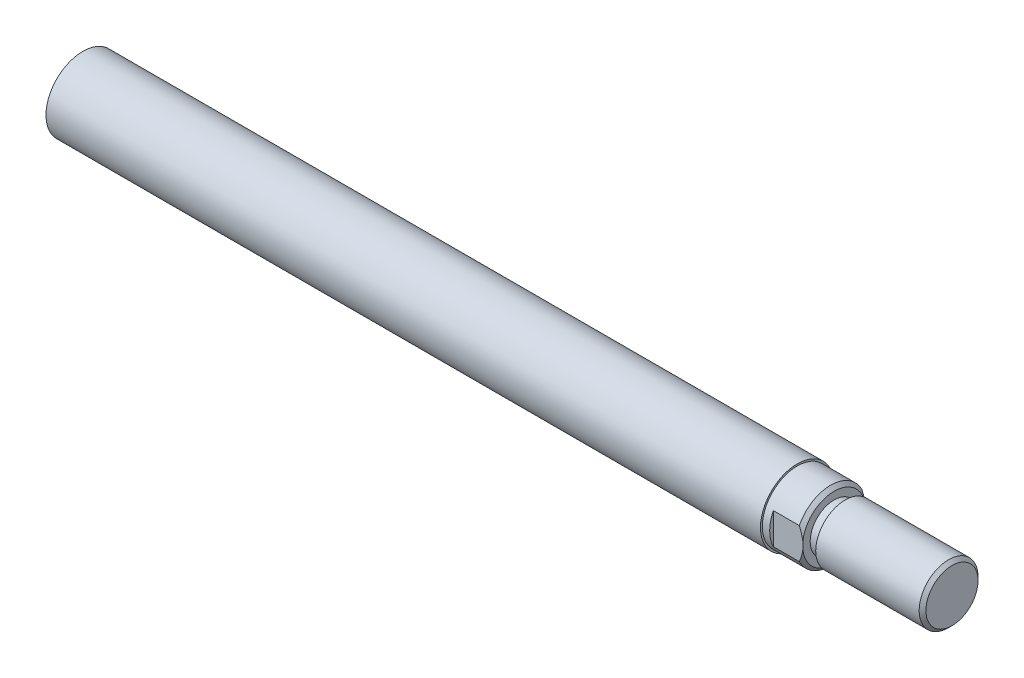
ISO-10303-21;
HEADER;
FILE_DESCRIPTION(('STEP AP214'),'2;1');
FILE_NAME('part.step','',(''),(''),'','','');
FILE_SCHEMA(('AUTOMOTIVE_DESIGN { 1 0 10303 214 1 1 1 1 }'));
ENDSEC;
DATA;
#1=APPLICATION_CONTEXT('core data for automotive mechanical design processes');
#2=APPLICATION_PROTOCOL_DEFINITION('international standard','automotive_design',2000,#1);
#3=PRODUCT_CONTEXT('',#1,'mechanical');
#4=PRODUCT('Part','Part','',(#3));
#5=PRODUCT_RELATED_PRODUCT_CATEGORY('part','',(#4));
#6=PRODUCT_DEFINITION_FORMATION('','',#4);
#7=PRODUCT_DEFINITION_CONTEXT('part definition',#1,'design');
#8=PRODUCT_DEFINITION('design','',#6,#7);
#9=PRODUCT_DEFINITION_SHAPE('','',#8);
#10=(LENGTH_UNIT() NAMED_UNIT(*) SI_UNIT(.MILLI.,.METRE.));
#11=(NAMED_UNIT(*) PLANE_ANGLE_UNIT() SI_UNIT($,.RADIAN.));
#12=(NAMED_UNIT(*) SI_UNIT($,.STERADIAN.) SOLID_ANGLE_UNIT());
#13=UNCERTAINTY_MEASURE_WITH_UNIT(LENGTH_MEASURE(1.E-05),#10,'distance_accuracy_value','');
#14=(GEOMETRIC_REPRESENTATION_CONTEXT(3) GLOBAL_UNCERTAINTY_ASSIGNED_CONTEXT((#13)) GLOBAL_UNIT_ASSIGNED_CONTEXT((#10,
#11,#12)) REPRESENTATION_CONTEXT('',''));
#15=CARTESIAN_POINT('',(0.,0.,0.));
#16=DIRECTION('',(0.,0.,1.));
#17=DIRECTION('',(1.,0.,0.));
#18=AXIS2_PLACEMENT_3D('',#15,#16,#17);
#19=CARTESIAN_POINT('',(-219.,0.,0.));
#20=DIRECTION('',(1.,0.,0.));
#21=DIRECTION('',(0.,0.,1.));
#22=AXIS2_PLACEMENT_3D('',#19,#20,#21);
#23=CYLINDRICAL_SURFACE('',#22,10.);
#24=CARTESIAN_POINT('',(-187.,0.,0.));
#25=DIRECTION('',(1.,0.,0.));
#26=DIRECTION('',(0.,0.,-1.));
#27=AXIS2_PLACEMENT_3D('',#24,#25,#26);
#28=CIRCLE('',#27,10.);
#29=CARTESIAN_POINT('',(-187.,0.,-10.));
#30=VERTEX_POINT('',#29);
#31=EDGE_CURVE('E128',#30,#30,#28,.F.);
#32=ORIENTED_EDGE('',*,*,#31,.F.);
#33=EDGE_LOOP('',(#32));
#34=FACE_BOUND('',#33,.T.);
#35=CARTESIAN_POINT('',(7.00000000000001,0.,0.));
#36=DIRECTION('',(-1.,0.,0.));
#37=DIRECTION('',(0.,0.,1.));
#38=AXIS2_PLACEMENT_3D('',#35,#36,#37);
#39=CIRCLE('',#38,10.);
#40=CARTESIAN_POINT('',(7.00000000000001,0.,10.));
#41=VERTEX_POINT('',#40);
#42=EDGE_CURVE('E234',#41,#41,#39,.T.);
#43=ORIENTED_EDGE('',*,*,#42,.T.);
#44=EDGE_LOOP('',(#43));
#45=FACE_BOUND('',#44,.T.);
#46=ADVANCED_FACE('F45',(#34,#45),#23,.T.);
#47=CARTESIAN_POINT('',(9.00000000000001,-17.,8.5));
#48=DIRECTION('',(0.,0.,-1.));
#49=DIRECTION('',(-1.,0.,0.));
#50=AXIS2_PLACEMENT_3D('',#47,#48,#49);
#51=PLANE('',#50);
#52=DIRECTION('',(0.,1.,0.));
#53=VECTOR('',#52,1.);
#54=CARTESIAN_POINT('',(17.,-17.,8.5));
#55=LINE('',#54,#53);
#56=CARTESIAN_POINT('',(17.,-0.923309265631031,8.5));
#57=VERTEX_POINT('',#56);
#58=CARTESIAN_POINT('',(17.,0.923309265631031,8.5));
#59=VERTEX_POINT('',#58);
#60=EDGE_CURVE('E133',#57,#59,#55,.T.);
#61=ORIENTED_EDGE('',*,*,#60,.T.);
#62=CARTESIAN_POINT('',(16.0500000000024,4.24264068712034,8.50000000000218));
#63=CARTESIAN_POINT('',(16.1108303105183,4.10642759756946,8.49999684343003));
#64=CARTESIAN_POINT('',(16.1697247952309,3.96933332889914,8.49998580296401));
#65=CARTESIAN_POINT('',(16.281839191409,3.69655476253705,8.49996516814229));
#66=CARTESIAN_POINT('',(16.3351590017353,3.56091145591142,8.49995554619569));
#67=CARTESIAN_POINT('',(16.4361343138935,3.29070114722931,8.49995329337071));
#68=CARTESIAN_POINT('',(16.4838837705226,3.15616940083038,8.49996031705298));
#69=CARTESIAN_POINT('',(16.5737176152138,2.8878314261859,8.49998693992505));
#70=CARTESIAN_POINT('',(16.615886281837,2.75405346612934,8.50000631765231));
#71=CARTESIAN_POINT('',(16.6972369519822,2.4778718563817,8.49999334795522));
#72=CARTESIAN_POINT('',(16.7361427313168,2.33538644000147,8.49995820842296));
#73=CARTESIAN_POINT('',(16.8070946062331,2.05151309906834,8.49989573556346));
#74=CARTESIAN_POINT('',(16.8392543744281,1.91015370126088,8.49986826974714));
#75=CARTESIAN_POINT('',(16.8967234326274,1.62795772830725,8.49986814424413));
#76=CARTESIAN_POINT('',(16.922116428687,1.48713829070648,8.49989477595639));
#77=CARTESIAN_POINT('',(16.9661190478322,1.20543874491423,8.49995424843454));
#78=CARTESIAN_POINT('',(16.9847741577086,1.06456572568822,8.49998704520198));
#79=CARTESIAN_POINT('',(17.,0.923309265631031,8.5));
#80=B_SPLINE_CURVE_WITH_KNOTS('',3,(#62,#63,#64,#65,#66,#67,#68,#69,#70,#71,#72,#73,#74,#75,#76,
#77,#78,#79),.UNSPECIFIED.,.F.,.F.,(4,2,2,2,2,2,2,2,4),(0.,0.447543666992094,0.884712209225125,
1.31288807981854,1.73359624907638,2.17657255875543,2.61134694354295,3.04046312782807,
3.46662571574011),.UNSPECIFIED.);
#81=CARTESIAN_POINT('',(16.05,4.24264068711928,8.5));
#82=VERTEX_POINT('',#81);
#83=EDGE_CURVE('E182',#82,#59,#80,.T.);
#84=ORIENTED_EDGE('',*,*,#83,.F.);
#85=DIRECTION('',(1.,0.,0.));
#86=VECTOR('',#85,1.);
#87=CARTESIAN_POINT('',(-239.,4.24264068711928,8.5));
#88=LINE('',#87,#86);
#89=CARTESIAN_POINT('',(9.00000000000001,4.24264068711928,8.5));
#90=VERTEX_POINT('',#89);
#91=EDGE_CURVE('E172',#90,#82,#88,.T.);
#92=ORIENTED_EDGE('',*,*,#91,.F.);
#93=DIRECTION('',(0.,1.,0.));
#94=VECTOR('',#93,1.);
#95=CARTESIAN_POINT('',(9.00000000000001,-17.,8.5));
#96=LINE('',#95,#94);
#97=CARTESIAN_POINT('',(9.00000000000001,-4.24264068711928,8.5));
#98=VERTEX_POINT('',#97);
#99=EDGE_CURVE('E227',#98,#90,#96,.T.);
#100=ORIENTED_EDGE('',*,*,#99,.F.);
#101=DIRECTION('',(-1.,0.,0.));
#102=VECTOR('',#101,1.);
#103=CARTESIAN_POINT('',(-239.,-4.24264068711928,8.5));
#104=LINE('',#103,#102);
#105=CARTESIAN_POINT('',(16.05,-4.24264068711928,8.5));
#106=VERTEX_POINT('',#105);
#107=EDGE_CURVE('E140',#106,#98,#104,.T.);
#108=ORIENTED_EDGE('',*,*,#107,.F.);
#109=CARTESIAN_POINT('',(17.,-0.923309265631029,8.5));
#110=CARTESIAN_POINT('',(16.9847986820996,-1.06433669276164,8.49998715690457));
#111=CARTESIAN_POINT('',(16.9661789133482,-1.20498190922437,8.49995492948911));
#112=CARTESIAN_POINT('',(16.9222674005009,-1.48623025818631,8.49989675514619));
#113=CARTESIAN_POINT('',(16.8969302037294,-1.62682631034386,8.49987085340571));
#114=CARTESIAN_POINT('',(16.8395930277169,-1.90857722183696,8.49987182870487));
#115=CARTESIAN_POINT('',(16.8075096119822,-2.04971501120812,8.49989940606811));
#116=CARTESIAN_POINT('',(16.7367308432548,-2.33314431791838,8.49996070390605));
#117=CARTESIAN_POINT('',(16.6979222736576,-2.47540744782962,8.49999453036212));
#118=CARTESIAN_POINT('',(16.6166508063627,-2.75158596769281,8.50000521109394));
#119=CARTESIAN_POINT('',(16.5744473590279,-2.88557807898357,8.49998468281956));
#120=CARTESIAN_POINT('',(16.4845233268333,-3.15434937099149,8.49995708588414));
#121=CARTESIAN_POINT('',(16.4367179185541,-3.28910011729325,8.49995026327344));
#122=CARTESIAN_POINT('',(16.3356105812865,-3.55975580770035,8.49995333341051));
#123=CARTESIAN_POINT('',(16.2822140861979,-3.69562527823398,8.49996358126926));
#124=CARTESIAN_POINT('',(16.1699261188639,-3.96886559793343,8.49998530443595));
#125=CARTESIAN_POINT('',(16.1109340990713,-4.10619519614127,8.49999680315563));
#126=CARTESIAN_POINT('',(16.0500000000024,-4.24264068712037,8.50000000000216));
#127=B_SPLINE_CURVE_WITH_KNOTS('',3,(#109,#110,#111,#112,#113,#114,#115,#116,#117,#118,#119,
#120,#121,#122,#123,#124,#125,#126),.UNSPECIFIED.,.F.,.F.,(4,2,2,2,2,2,2,2,4),(0.,
0.425471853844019,0.853899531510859,1.28797548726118,1.7302322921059,2.15158395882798,
2.58043464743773,3.01831843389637,3.46662578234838),.UNSPECIFIED.);
#128=EDGE_CURVE('E248',#57,#106,#127,.T.);
#129=ORIENTED_EDGE('',*,*,#128,.F.);
#130=EDGE_LOOP('',(#61,#84,#92,#100,#108,#129));
#131=FACE_BOUND('',#130,.T.);
#132=ADVANCED_FACE('F151',(#131),#51,.F.);
#133=CARTESIAN_POINT('',(7.00000000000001,9.5,0.));
#134=DIRECTION('',(-1.,0.,0.));
#135=DIRECTION('',(0.,1.,0.));
#136=AXIS2_PLACEMENT_3D('',#133,#134,#135);
#137=PLANE('',#136);
#138=ORIENTED_EDGE('',*,*,#42,.F.);
#139=EDGE_LOOP('',(#138));
#140=FACE_BOUND('',#139,.T.);
#141=CARTESIAN_POINT('',(7.00000000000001,0.,0.));
#142=DIRECTION('',(-1.,0.,0.));
#143=DIRECTION('',(0.,0.,1.));
#144=AXIS2_PLACEMENT_3D('',#141,#142,#143);
#145=CIRCLE('',#144,9.5);
#146=CARTESIAN_POINT('',(7.00000000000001,0.,9.5));
#147=VERTEX_POINT('',#146);
#148=EDGE_CURVE('E229',#147,#147,#145,.T.);
#149=ORIENTED_EDGE('',*,*,#148,.T.);
#150=EDGE_LOOP('',(#149));
#151=FACE_BOUND('',#150,.T.);
#152=ADVANCED_FACE('F161',(#140,#151),#137,.F.);
#153=CARTESIAN_POINT('',(-239.,0.,0.));
#154=DIRECTION('',(1.,0.,0.));
#155=DIRECTION('',(0.,0.,1.));
#156=AXIS2_PLACEMENT_3D('',#153,#154,#155);
#157=CYLINDRICAL_SURFACE('',#156,9.5);
#158=CARTESIAN_POINT('',(16.05,0.,0.));
#159=DIRECTION('',(-1.,0.,0.));
#160=DIRECTION('',(0.,0.,1.));
#161=AXIS2_PLACEMENT_3D('',#158,#159,#160);
#162=CIRCLE('',#161,9.5);
#163=CARTESIAN_POINT('',(16.05,4.24264068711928,-8.5));
#164=VERTEX_POINT('',#163);
#165=EDGE_CURVE('E233',#82,#164,#162,.T.);
#166=ORIENTED_EDGE('',*,*,#165,.T.);
#167=DIRECTION('',(-1.,0.,0.));
#168=VECTOR('',#167,1.);
#169=CARTESIAN_POINT('',(-239.,4.24264068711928,-8.5));
#170=LINE('',#169,#168);
#171=CARTESIAN_POINT('',(9.00000000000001,4.24264068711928,-8.5));
#172=VERTEX_POINT('',#171);
#173=EDGE_CURVE('E222',#164,#172,#170,.T.);
#174=ORIENTED_EDGE('',*,*,#173,.T.);
#175=CARTESIAN_POINT('',(9.00000000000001,0.,0.));
#176=DIRECTION('',(-1.,0.,0.));
#177=DIRECTION('',(0.,0.,1.));
#178=AXIS2_PLACEMENT_3D('',#175,#176,#177);
#179=CIRCLE('',#178,9.5);
#180=CARTESIAN_POINT('',(9.00000000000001,-4.24264068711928,-8.5));
#181=VERTEX_POINT('',#180);
#182=EDGE_CURVE('E217',#172,#181,#179,.T.);
#183=ORIENTED_EDGE('',*,*,#182,.T.);
#184=DIRECTION('',(1.,0.,0.));
#185=VECTOR('',#184,1.);
#186=CARTESIAN_POINT('',(-239.,-4.24264068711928,-8.5));
#187=LINE('',#186,#185);
#188=CARTESIAN_POINT('',(16.05,-4.24264068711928,-8.5));
#189=VERTEX_POINT('',#188);
#190=EDGE_CURVE('E221',#181,#189,#187,.T.);
#191=ORIENTED_EDGE('',*,*,#190,.T.);
#192=CARTESIAN_POINT('',(16.05,0.,0.));
#193=DIRECTION('',(-1.,0.,0.));
#194=DIRECTION('',(0.,0.,1.));
#195=AXIS2_PLACEMENT_3D('',#192,#193,#194);
#196=CIRCLE('',#195,9.5);
#197=EDGE_CURVE('E145',#189,#106,#196,.T.);
#198=ORIENTED_EDGE('',*,*,#197,.T.);
#199=ORIENTED_EDGE('',*,*,#107,.T.);
#200=CARTESIAN_POINT('',(9.00000000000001,0.,0.));
#201=DIRECTION('',(-1.,0.,0.));
#202=DIRECTION('',(0.,0.,1.));
#203=AXIS2_PLACEMENT_3D('',#200,#201,#202);
#204=CIRCLE('',#203,9.5);
#205=EDGE_CURVE('E144',#98,#90,#204,.T.);
#206=ORIENTED_EDGE('',*,*,#205,.T.);
#207=ORIENTED_EDGE('',*,*,#91,.T.);
#208=EDGE_LOOP('',(#166,#174,#183,#191,#198,#199,#206,#207));
#209=FACE_BOUND('',#208,.T.);
#210=ORIENTED_EDGE('',*,*,#148,.F.);
#211=EDGE_LOOP('',(#210));
#212=FACE_BOUND('',#211,.T.);
#213=ADVANCED_FACE('F163',(#209,#212),#157,.T.);
#214=CARTESIAN_POINT('',(17.,0.,0.));
#215=DIRECTION('',(-1.,0.,0.));
#216=DIRECTION('',(0.,0.,1.));
#217=AXIS2_PLACEMENT_3D('',#214,#215,#216);
#218=CONICAL_SURFACE('',#217,8.55,0.7853981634);
#219=CARTESIAN_POINT('',(17.,0.,0.));
#220=DIRECTION('',(-1.,0.,0.));
#221=DIRECTION('',(0.,0.,1.));
#222=AXIS2_PLACEMENT_3D('',#219,#220,#221);
#223=CIRCLE('',#222,8.55);
#224=CARTESIAN_POINT('',(17.,0.923309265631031,-8.5));
#225=VERTEX_POINT('',#224);
#226=EDGE_CURVE('E307',#59,#225,#223,.T.);
#227=ORIENTED_EDGE('',*,*,#226,.T.);
#228=CARTESIAN_POINT('',(17.,0.923309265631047,-8.5));
#229=CARTESIAN_POINT('',(16.9847986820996,1.06433669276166,-8.49998715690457));
#230=CARTESIAN_POINT('',(16.9661789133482,1.20498190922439,-8.49995492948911));
#231=CARTESIAN_POINT('',(16.9222674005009,1.48623025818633,-8.49989675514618));
#232=CARTESIAN_POINT('',(16.8969302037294,1.62682631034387,-8.49987085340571));
#233=CARTESIAN_POINT('',(16.8395930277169,1.90857722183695,-8.49987182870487));
#234=CARTESIAN_POINT('',(16.8075096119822,2.04971501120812,-8.49989940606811));
#235=CARTESIAN_POINT('',(16.7367308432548,2.33314431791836,-8.49996070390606));
#236=CARTESIAN_POINT('',(16.6979222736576,2.4754074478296,-8.49999453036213));
#237=CARTESIAN_POINT('',(16.6166508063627,2.75158596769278,-8.50000521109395));
#238=CARTESIAN_POINT('',(16.5744473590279,2.88557807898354,-8.49998468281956));
#239=CARTESIAN_POINT('',(16.4845233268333,3.15434937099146,-8.49995708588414));
#240=CARTESIAN_POINT('',(16.4367179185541,3.28910011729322,-8.49995026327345));
#241=CARTESIAN_POINT('',(16.3356105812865,3.55975580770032,-8.49995333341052));
#242=CARTESIAN_POINT('',(16.2822140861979,3.69562527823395,-8.49996358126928));
#243=CARTESIAN_POINT('',(16.1699261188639,3.9688655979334,-8.49998530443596));
#244=CARTESIAN_POINT('',(16.1109340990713,4.10619519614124,-8.49999680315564));
#245=CARTESIAN_POINT('',(16.0500000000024,4.24264068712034,-8.50000000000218));
#246=B_SPLINE_CURVE_WITH_KNOTS('',3,(#228,#229,#230,#231,#232,#233,#234,#235,#236,#237,#238,
#239,#240,#241,#242,#243,#244,#245),.UNSPECIFIED.,.F.,.F.,(4,2,2,2,2,2,2,2,4),(0.,
0.425471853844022,0.853899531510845,1.28797548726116,1.73023229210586,2.15158395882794,
2.58043464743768,3.01831843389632,3.46662578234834),.UNSPECIFIED.);
#247=EDGE_CURVE('E62',#225,#164,#246,.T.);
#248=ORIENTED_EDGE('',*,*,#247,.T.);
#249=ORIENTED_EDGE('',*,*,#165,.F.);
#250=ORIENTED_EDGE('',*,*,#83,.T.);
#251=EDGE_LOOP('',(#227,#248,#249,#250));
#252=FACE_BOUND('',#251,.T.);
#253=ADVANCED_FACE('F189',(#252),#218,.T.);
#254=CARTESIAN_POINT('',(17.,0.,0.));
#255=DIRECTION('',(-1.,0.,0.));
#256=DIRECTION('',(0.,0.,1.));
#257=AXIS2_PLACEMENT_3D('',#254,#255,#256);
#258=CONICAL_SURFACE('',#257,8.55,0.7853981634);
#259=ORIENTED_EDGE('',*,*,#197,.F.);
#260=CARTESIAN_POINT('',(16.0500000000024,-4.24264068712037,-8.50000000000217));
#261=CARTESIAN_POINT('',(16.1108303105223,-4.10642759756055,-8.49999684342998));
#262=CARTESIAN_POINT('',(16.1697247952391,-3.96933332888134,-8.49998580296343));
#263=CARTESIAN_POINT('',(16.2818391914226,-3.69655476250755,-8.49996516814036));
#264=CARTESIAN_POINT('',(16.3351590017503,-3.56091145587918,-8.49995554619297));
#265=CARTESIAN_POINT('',(16.4361343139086,-3.2907011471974,-8.4999532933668));
#266=CARTESIAN_POINT('',(16.4838837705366,-3.15616940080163,-8.49996031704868));
#267=CARTESIAN_POINT('',(16.5737176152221,-2.88783142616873,-8.49998693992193));
#268=CARTESIAN_POINT('',(16.615886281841,-2.75405346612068,-8.50000631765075));
#269=CARTESIAN_POINT('',(16.6972369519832,-2.47787185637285,-8.49999334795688));
#270=CARTESIAN_POINT('',(16.7361427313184,-2.3353864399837,-8.49995820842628));
#271=CARTESIAN_POINT('',(16.8070946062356,-2.05151309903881,-8.49989573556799));
#272=CARTESIAN_POINT('',(16.8392543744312,-1.91015370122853,-8.49986826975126));
#273=CARTESIAN_POINT('',(16.8967234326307,-1.62795772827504,-8.49986814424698));
#274=CARTESIAN_POINT('',(16.92211642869,-1.48713829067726,-8.49989477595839));
#275=CARTESIAN_POINT('',(16.9661190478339,-1.20543874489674,-8.49995424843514));
#276=CARTESIAN_POINT('',(16.9847741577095,-1.06456572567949,-8.49998704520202));
#277=CARTESIAN_POINT('',(17.,-0.923309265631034,-8.5));
#278=B_SPLINE_CURVE_WITH_KNOTS('',3,(#260,#261,#262,#263,#264,#265,#266,#267,#268,#269,#270,
#271,#272,#273,#274,#275,#276,#277),.UNSPECIFIED.,.F.,.F.,(4,2,2,2,2,2,2,2,4),(0.,
0.447543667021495,0.884712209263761,1.31288807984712,1.73359624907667,2.17657255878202,
2.61134694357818,3.04046312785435,3.46662571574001),.UNSPECIFIED.);
#279=CARTESIAN_POINT('',(17.,-0.923309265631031,-8.5));
#280=VERTEX_POINT('',#279);
#281=EDGE_CURVE('E335',#189,#280,#278,.T.);
#282=ORIENTED_EDGE('',*,*,#281,.T.);
#283=CARTESIAN_POINT('',(17.,0.,0.));
#284=DIRECTION('',(-1.,0.,0.));
#285=DIRECTION('',(0.,0.,1.));
#286=AXIS2_PLACEMENT_3D('',#283,#284,#285);
#287=CIRCLE('',#286,8.55);
#288=EDGE_CURVE('E359',#280,#57,#287,.T.);
#289=ORIENTED_EDGE('',*,*,#288,.T.);
#290=ORIENTED_EDGE('',*,*,#128,.T.);
#291=EDGE_LOOP('',(#259,#282,#289,#290));
#292=FACE_BOUND('',#291,.T.);
#293=ADVANCED_FACE('F199',(#292),#258,.T.);
#294=CARTESIAN_POINT('',(49.,0.,0.));
#295=DIRECTION('',(-1.,0.,0.));
#296=DIRECTION('',(0.,1.,0.));
#297=AXIS2_PLACEMENT_3D('',#294,#295,#296);
#298=PLANE('',#297);
#299=CARTESIAN_POINT('',(49.,0.,0.));
#300=DIRECTION('',(-1.,0.,0.));
#301=DIRECTION('',(0.,0.,1.));
#302=AXIS2_PLACEMENT_3D('',#299,#300,#301);
#303=CIRCLE('',#302,7.08);
#304=CARTESIAN_POINT('',(49.,0.,7.08));
#305=VERTEX_POINT('',#304);
#306=EDGE_CURVE('E243',#305,#305,#303,.T.);
#307=ORIENTED_EDGE('',*,*,#306,.F.);
#308=EDGE_LOOP('',(#307));
#309=FACE_BOUND('',#308,.T.);
#310=ADVANCED_FACE('F274',(#309),#298,.F.);
#311=CARTESIAN_POINT('',(49.,0.,0.));
#312=DIRECTION('',(-1.,0.,0.));
#313=DIRECTION('',(0.,0.,1.));
#314=AXIS2_PLACEMENT_3D('',#311,#312,#313);
#315=CONICAL_SURFACE('',#314,7.08,0.7853981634);
#316=CARTESIAN_POINT('',(48.08,0.,0.));
#317=DIRECTION('',(-1.,0.,0.));
#318=DIRECTION('',(0.,0.,1.));
#319=AXIS2_PLACEMENT_3D('',#316,#317,#318);
#320=CIRCLE('',#319,8.);
#321=CARTESIAN_POINT('',(48.08,0.,8.));
#322=VERTEX_POINT('',#321);
#323=EDGE_CURVE('E247',#322,#322,#320,.T.);
#324=ORIENTED_EDGE('',*,*,#323,.F.);
#325=EDGE_LOOP('',(#324));
#326=FACE_BOUND('',#325,.T.);
#327=ORIENTED_EDGE('',*,*,#306,.T.);
#328=EDGE_LOOP('',(#327));
#329=FACE_BOUND('',#328,.T.);
#330=ADVANCED_FACE('F267',(#326,#329),#315,.T.);
#331=CARTESIAN_POINT('',(-239.,0.,0.));
#332=DIRECTION('',(1.,0.,0.));
#333=DIRECTION('',(0.,0.,1.));
#334=AXIS2_PLACEMENT_3D('',#331,#332,#333);
#335=CYLINDRICAL_SURFACE('',#334,8.);
#336=ORIENTED_EDGE('',*,*,#323,.T.);
#337=EDGE_LOOP('',(#336));
#338=FACE_BOUND('',#337,.T.);
#339=CARTESIAN_POINT('',(20.,0.,0.));
#340=DIRECTION('',(-1.,0.,0.));
#341=DIRECTION('',(0.,0.,1.));
#342=AXIS2_PLACEMENT_3D('',#339,#340,#341);
#343=CIRCLE('',#342,8.);
#344=CARTESIAN_POINT('',(20.,0.,8.));
#345=VERTEX_POINT('',#344);
#346=EDGE_CURVE('E48',#345,#345,#343,.T.);
#347=ORIENTED_EDGE('',*,*,#346,.F.);
#348=EDGE_LOOP('',(#347));
#349=FACE_BOUND('',#348,.T.);
#350=ADVANCED_FACE('F265',(#338,#349),#335,.T.);
#351=CARTESIAN_POINT('',(20.,8.,0.));
#352=DIRECTION('',(1.,0.,0.));
#353=DIRECTION('',(0.,0.,-1.));
#354=AXIS2_PLACEMENT_3D('',#351,#352,#353);
#355=PLANE('',#354);
#356=ORIENTED_EDGE('',*,*,#346,.T.);
#357=EDGE_LOOP('',(#356));
#358=FACE_BOUND('',#357,.T.);
#359=CARTESIAN_POINT('',(20.,0.,0.));
#360=DIRECTION('',(-1.,0.,0.));
#361=DIRECTION('',(0.,0.,1.));
#362=AXIS2_PLACEMENT_3D('',#359,#360,#361);
#363=CIRCLE('',#362,6.5);
#364=CARTESIAN_POINT('',(20.,0.,6.5));
#365=VERTEX_POINT('',#364);
#366=EDGE_CURVE('E228',#365,#365,#363,.T.);
#367=ORIENTED_EDGE('',*,*,#366,.F.);
#368=EDGE_LOOP('',(#367));
#369=FACE_BOUND('',#368,.T.);
#370=ADVANCED_FACE('F262',(#358,#369),#355,.F.);
#371=CARTESIAN_POINT('',(-239.,0.,0.));
#372=DIRECTION('',(1.,0.,0.));
#373=DIRECTION('',(0.,0.,1.));
#374=AXIS2_PLACEMENT_3D('',#371,#372,#373);
#375=CYLINDRICAL_SURFACE('',#374,6.5);
#376=ORIENTED_EDGE('',*,*,#366,.T.);
#377=EDGE_LOOP('',(#376));
#378=FACE_BOUND('',#377,.T.);
#379=CARTESIAN_POINT('',(17.,0.,0.));
#380=DIRECTION('',(-1.,0.,0.));
#381=DIRECTION('',(0.,0.,1.));
#382=AXIS2_PLACEMENT_3D('',#379,#380,#381);
#383=CIRCLE('',#382,6.5);
#384=CARTESIAN_POINT('',(17.,0.,6.5));
#385=VERTEX_POINT('',#384);
#386=EDGE_CURVE('E223',#385,#385,#383,.T.);
#387=ORIENTED_EDGE('',*,*,#386,.F.);
#388=EDGE_LOOP('',(#387));
#389=FACE_BOUND('',#388,.T.);
#390=ADVANCED_FACE('F273',(#378,#389),#375,.T.);
#391=CARTESIAN_POINT('',(17.,6.5,0.));
#392=DIRECTION('',(-1.,0.,0.));
#393=DIRECTION('',(0.,1.,0.));
#394=AXIS2_PLACEMENT_3D('',#391,#392,#393);
#395=PLANE('',#394);
#396=ORIENTED_EDGE('',*,*,#226,.F.);
#397=ORIENTED_EDGE('',*,*,#60,.F.);
#398=ORIENTED_EDGE('',*,*,#288,.F.);
#399=DIRECTION('',(0.,-1.,0.));
#400=VECTOR('',#399,1.);
#401=CARTESIAN_POINT('',(17.,17.,-8.5));
#402=LINE('',#401,#400);
#403=EDGE_CURVE('E11',#225,#280,#402,.T.);
#404=ORIENTED_EDGE('',*,*,#403,.F.);
#405=EDGE_LOOP('',(#396,#397,#398,#404));
#406=FACE_BOUND('',#405,.T.);
#407=ORIENTED_EDGE('',*,*,#386,.T.);
#408=EDGE_LOOP('',(#407));
#409=FACE_BOUND('',#408,.T.);
#410=ADVANCED_FACE('F203',(#406,#409),#395,.F.);
#411=CARTESIAN_POINT('',(9.00000000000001,0.,0.));
#412=DIRECTION('',(-1.,0.,0.));
#413=DIRECTION('',(0.,1.,0.));
#414=AXIS2_PLACEMENT_3D('',#411,#412,#413);
#415=PLANE('',#414);
#416=ORIENTED_EDGE('',*,*,#99,.T.);
#417=ORIENTED_EDGE('',*,*,#205,.F.);
#418=EDGE_LOOP('',(#416,#417));
#419=FACE_BOUND('',#418,.T.);
#420=ADVANCED_FACE('F377',(#419),#415,.F.);
#421=CARTESIAN_POINT('',(9.00000000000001,0.,0.));
#422=DIRECTION('',(-1.,0.,0.));
#423=DIRECTION('',(0.,1.,0.));
#424=AXIS2_PLACEMENT_3D('',#421,#422,#423);
#425=PLANE('',#424);
#426=DIRECTION('',(0.,-1.,0.));
#427=VECTOR('',#426,1.);
#428=CARTESIAN_POINT('',(9.00000000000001,17.,-8.5));
#429=LINE('',#428,#427);
#430=EDGE_CURVE('E55',#172,#181,#429,.T.);
#431=ORIENTED_EDGE('',*,*,#430,.T.);
#432=ORIENTED_EDGE('',*,*,#182,.F.);
#433=EDGE_LOOP('',(#431,#432));
#434=FACE_BOUND('',#433,.T.);
#435=ADVANCED_FACE('F319',(#434),#425,.F.);
#436=CARTESIAN_POINT('',(9.00000000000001,17.,-8.5));
#437=DIRECTION('',(0.,0.,1.));
#438=DIRECTION('',(0.,-1.,0.));
#439=AXIS2_PLACEMENT_3D('',#436,#437,#438);
#440=PLANE('',#439);
#441=ORIENTED_EDGE('',*,*,#403,.T.);
#442=ORIENTED_EDGE('',*,*,#281,.F.);
#443=ORIENTED_EDGE('',*,*,#190,.F.);
#444=ORIENTED_EDGE('',*,*,#430,.F.);
#445=ORIENTED_EDGE('',*,*,#173,.F.);
#446=ORIENTED_EDGE('',*,*,#247,.F.);
#447=EDGE_LOOP('',(#441,#442,#443,#444,#445,#446));
#448=FACE_BOUND('',#447,.T.);
#449=ADVANCED_FACE('F311',(#448),#440,.F.);
#450=CARTESIAN_POINT('',(-187.,0.,0.));
#451=DIRECTION('',(1.,0.,0.));
#452=DIRECTION('',(0.,0.,-1.));
#453=AXIS2_PLACEMENT_3D('',#450,#451,#452);
#454=PLANE('',#453);
#455=CARTESIAN_POINT('',(-187.,0.,0.));
#456=DIRECTION('',(-1.,0.,0.));
#457=DIRECTION('',(0.,0.,1.));
#458=AXIS2_PLACEMENT_3D('',#455,#456,#457);
#459=CIRCLE('',#458,4.25);
#460=CARTESIAN_POINT('',(-187.,0.,4.25));
#461=VERTEX_POINT('',#460);
#462=EDGE_CURVE('E129',#461,#461,#459,.T.);
#463=ORIENTED_EDGE('',*,*,#462,.F.);
#464=EDGE_LOOP('',(#463));
#465=FACE_BOUND('',#464,.T.);
#466=ORIENTED_EDGE('',*,*,#31,.T.);
#467=EDGE_LOOP('',(#466));
#468=FACE_BOUND('',#467,.T.);
#469=ADVANCED_FACE('F122',(#465,#468),#454,.F.);
#470=CARTESIAN_POINT('',(-167.,0.,0.));
#471=DIRECTION('',(-1.,0.,0.));
#472=DIRECTION('',(0.,0.,1.));
#473=AXIS2_PLACEMENT_3D('',#470,#471,#472);
#474=CONICAL_SURFACE('',#473,4.24999999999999,1.02974425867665);
#475=CARTESIAN_POINT('',(-164.446342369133,0.,0.));
#476=VERTEX_POINT('',#475);
#477=VERTEX_LOOP('',#476);
#478=FACE_BOUND('',#477,.T.);
#479=CARTESIAN_POINT('',(-167.,0.,0.));
#480=DIRECTION('',(-1.,0.,0.));
#481=DIRECTION('',(0.,0.,1.));
#482=AXIS2_PLACEMENT_3D('',#479,#480,#481);
#483=CIRCLE('',#482,4.24999999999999);
#484=CARTESIAN_POINT('',(-167.,0.,4.24999999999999));
#485=VERTEX_POINT('',#484);
#486=EDGE_CURVE('E126',#485,#485,#483,.T.);
#487=ORIENTED_EDGE('',*,*,#486,.T.);
#488=EDGE_LOOP('',(#487));
#489=FACE_BOUND('',#488,.T.);
#490=ADVANCED_FACE('F118',(#478,#489),#474,.F.);
#491=CARTESIAN_POINT('',(-187.,0.,0.));
#492=DIRECTION('',(-1.,0.,0.));
#493=DIRECTION('',(0.,0.,1.));
#494=AXIS2_PLACEMENT_3D('',#491,#492,#493);
#495=CYLINDRICAL_SURFACE('',#494,4.25);
#496=ORIENTED_EDGE('',*,*,#486,.F.);
#497=EDGE_LOOP('',(#496));
#498=FACE_BOUND('',#497,.T.);
#499=ORIENTED_EDGE('',*,*,#462,.T.);
#500=EDGE_LOOP('',(#499));
#501=FACE_BOUND('',#500,.T.);
#502=ADVANCED_FACE('F121',(#498,#501),#495,.F.);
#503=CLOSED_SHELL('',(#46,#132,#152,#213,#253,#293,#310,#330,#350,#370,#390,#410,#420,#435,#449,
#469,#490,#502));
#504=MANIFOLD_SOLID_BREP('B2',#503);
#505=ADVANCED_BREP_SHAPE_REPRESENTATION('',(#18,#504),#14);
#506=SHAPE_DEFINITION_REPRESENTATION(#9,#505);
ENDSEC;
END-ISO-10303-21;
